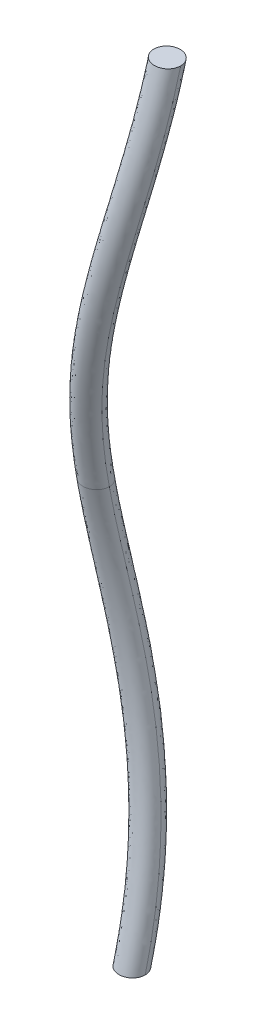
ISO-10303-21;
HEADER;
FILE_DESCRIPTION(('STEP AP214'),'2;1');
FILE_NAME('part.step','',(''),(''),'','','');
FILE_SCHEMA(('AUTOMOTIVE_DESIGN { 1 0 10303 214 1 1 1 1 }'));
ENDSEC;
DATA;
#1=APPLICATION_CONTEXT('core data for automotive mechanical design processes');
#2=APPLICATION_PROTOCOL_DEFINITION('international standard','automotive_design',2000,#1);
#3=PRODUCT_CONTEXT('',#1,'mechanical');
#4=PRODUCT('Part','Part','',(#3));
#5=PRODUCT_RELATED_PRODUCT_CATEGORY('part','',(#4));
#6=PRODUCT_DEFINITION_FORMATION('','',#4);
#7=PRODUCT_DEFINITION_CONTEXT('part definition',#1,'design');
#8=PRODUCT_DEFINITION('design','',#6,#7);
#9=PRODUCT_DEFINITION_SHAPE('','',#8);
#10=(LENGTH_UNIT() NAMED_UNIT(*) SI_UNIT(.MILLI.,.METRE.));
#11=(NAMED_UNIT(*) PLANE_ANGLE_UNIT() SI_UNIT($,.RADIAN.));
#12=(NAMED_UNIT(*) SI_UNIT($,.STERADIAN.) SOLID_ANGLE_UNIT());
#13=UNCERTAINTY_MEASURE_WITH_UNIT(LENGTH_MEASURE(1.E-05),#10,'distance_accuracy_value','');
#14=(GEOMETRIC_REPRESENTATION_CONTEXT(3) GLOBAL_UNCERTAINTY_ASSIGNED_CONTEXT((#13)) GLOBAL_UNIT_ASSIGNED_CONTEXT((#10,
#11,#12)) REPRESENTATION_CONTEXT('',''));
#15=CARTESIAN_POINT('',(0.,0.,0.));
#16=DIRECTION('',(0.,0.,1.));
#17=DIRECTION('',(1.,0.,0.));
#18=AXIS2_PLACEMENT_3D('',#15,#16,#17);
#19=CARTESIAN_POINT('',(-49.666083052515,6.47438122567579,-35.56104775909));
#20=DIRECTION('',(-0.0440198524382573,-0.999030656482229,0.));
#21=DIRECTION('',(0.999030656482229,-0.0440198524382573,0.));
#22=AXIS2_PLACEMENT_3D('',#19,#20,#21);
#23=PLANE('',#22);
#24=CARTESIAN_POINT('',(-48.6377300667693,6.42906935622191,-35.5610477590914));
#25=CARTESIAN_POINT('',(-48.6377539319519,6.42907040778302,-35.5329193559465));
#26=CARTESIAN_POINT('',(-48.6353601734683,6.42896493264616,-35.5047980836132));
#27=CARTESIAN_POINT('',(-48.6259132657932,6.42854867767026,-35.4493710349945));
#28=CARTESIAN_POINT('',(-48.6188635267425,6.42823804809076,-35.4220646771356));
#29=CARTESIAN_POINT('',(-48.6002757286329,6.42741902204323,-35.3690129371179));
#30=CARTESIAN_POINT('',(-48.5887355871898,6.42691053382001,-35.3432682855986));
#31=CARTESIAN_POINT('',(-48.5615049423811,6.42571068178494,-35.2940883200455));
#32=CARTESIAN_POINT('',(-48.5458152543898,6.42501935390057,-35.2706525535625));
#33=CARTESIAN_POINT('',(-48.5107384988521,6.42347378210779,-35.2267634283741));
#34=CARTESIAN_POINT('',(-48.4913536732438,6.42261963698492,-35.2063082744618));
#35=CARTESIAN_POINT('',(-48.4494007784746,6.42077108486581,-35.1689167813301));
#36=CARTESIAN_POINT('',(-48.4268282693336,6.41977648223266,-35.1519854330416));
#37=CARTESIAN_POINT('',(-48.3791991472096,6.41767782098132,-35.1221823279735));
#38=CARTESIAN_POINT('',(-48.354146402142,6.41657393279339,-35.1093043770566));
#39=CARTESIAN_POINT('',(-48.3021942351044,6.41428478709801,-35.0879196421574));
#40=CARTESIAN_POINT('',(-48.2752918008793,6.41309939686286,-35.0794201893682));
#41=CARTESIAN_POINT('',(-48.2204426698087,6.41068260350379,-35.0670668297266));
#42=CARTESIAN_POINT('',(-48.192495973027,6.40945120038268,-35.0632129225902));
#43=CARTESIAN_POINT('',(-48.1363999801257,6.40697946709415,-35.0602625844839));
#44=CARTESIAN_POINT('',(-48.1082510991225,6.40573915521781,-35.0611582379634));
#45=CARTESIAN_POINT('',(-48.052460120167,6.40328086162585,-35.0676682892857));
#46=CARTESIAN_POINT('',(-48.0248188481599,6.40206291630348,-35.0732897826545));
#47=CARTESIAN_POINT('',(-47.9709089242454,6.39968750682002,-35.0890903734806));
#48=CARTESIAN_POINT('',(-47.944638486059,6.39852996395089,-35.099263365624));
#49=CARTESIAN_POINT('',(-47.8941574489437,6.39630564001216,-35.1238855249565));
#50=CARTESIAN_POINT('',(-47.8699482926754,6.39523892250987,-35.138337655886));
#51=CARTESIAN_POINT('',(-47.8242988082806,6.39322748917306,-35.1711044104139));
#52=CARTESIAN_POINT('',(-47.8028583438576,6.39228276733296,-35.1894188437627));
#53=CARTESIAN_POINT('',(-47.7633523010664,6.39054202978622,-35.2293916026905));
#54=CARTESIAN_POINT('',(-47.7452868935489,6.38974602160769,-35.2510500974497));
#55=CARTESIAN_POINT('',(-47.7130463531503,6.38832542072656,-35.2970949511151));
#56=CARTESIAN_POINT('',(-47.6988710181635,6.38770081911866,-35.3214811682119));
#57=CARTESIAN_POINT('',(-47.6748009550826,6.38664023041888,-35.3723076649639));
#58=CARTESIAN_POINT('',(-47.664909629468,6.38620439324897,-35.3987495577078));
#59=CARTESIAN_POINT('',(-47.6497214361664,6.38553516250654,-35.4528874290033));
#60=CARTESIAN_POINT('',(-47.6444175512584,6.38530145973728,-35.4805814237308));
#61=CARTESIAN_POINT('',(-47.6396191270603,6.385090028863,-35.5259642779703));
#62=CARTESIAN_POINT('',(-47.6386919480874,6.38504917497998,-35.5435106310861));
#63=CARTESIAN_POINT('',(-47.6386994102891,6.38504950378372,-35.56104775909));
#64=B_SPLINE_CURVE_WITH_KNOTS('',3,(#24,#25,#26,#27,#28,#29,#30,#31,#32,#33,#34,#35,#36,#37,#38,
#39,#40,#41,#42,#43,#44,#45,#46,#47,#48,#49,#50,#51,#52,#53,#54,#55,#56,#57,#58,#59,#60,#61,#62,
#63),.UNSPECIFIED.,.F.,.F.,(4,2,2,2,2,2,2,2,2,2,2,2,2,2,2,2,2,2,2,4),(0.,0.0842731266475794,
0.168484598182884,0.252735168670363,0.336969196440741,0.421152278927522,0.505453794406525,
0.589625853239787,0.673938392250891,0.758250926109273,0.842422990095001,0.926721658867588,
1.01090758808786,1.0951519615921,1.17939218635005,1.26363667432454,1.34787678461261,
1.43218367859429,1.5163613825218,1.56897272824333),.UNSPECIFIED.);
#65=CARTESIAN_POINT('',(-48.6377300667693,6.42906935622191,-35.5610477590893));
#66=VERTEX_POINT('',#65);
#67=CARTESIAN_POINT('',(-47.6386994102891,6.38504950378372,-35.56104775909));
#68=VERTEX_POINT('',#67);
#69=EDGE_CURVE('E56',#66,#68,#64,.T.);
#70=ORIENTED_EDGE('',*,*,#69,.T.);
#71=CARTESIAN_POINT('',(-47.6386994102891,6.38504950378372,-35.56104775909));
#72=CARTESIAN_POINT('',(-47.6386755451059,6.38504845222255,-35.5891761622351));
#73=CARTESIAN_POINT('',(-47.6410693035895,6.38515392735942,-35.6172974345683));
#74=CARTESIAN_POINT('',(-47.6505162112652,6.38557018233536,-35.6727244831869));
#75=CARTESIAN_POINT('',(-47.6575659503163,6.38588081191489,-35.7000308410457));
#76=CARTESIAN_POINT('',(-47.676153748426,6.38669983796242,-35.7530825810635));
#77=CARTESIAN_POINT('',(-47.6876938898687,6.3872083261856,-35.778827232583));
#78=CARTESIAN_POINT('',(-47.7149245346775,6.38840817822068,-35.828007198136));
#79=CARTESIAN_POINT('',(-47.7306142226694,6.38909950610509,-35.8514429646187));
#80=CARTESIAN_POINT('',(-47.7656909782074,6.39064507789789,-35.895332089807));
#81=CARTESIAN_POINT('',(-47.7850758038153,6.39149922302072,-35.9157872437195));
#82=CARTESIAN_POINT('',(-47.8270286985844,6.39334777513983,-35.953178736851));
#83=CARTESIAN_POINT('',(-47.8496012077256,6.39434237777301,-35.9701100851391));
#84=CARTESIAN_POINT('',(-47.8972303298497,6.39644103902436,-35.9999131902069));
#85=CARTESIAN_POINT('',(-47.9222830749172,6.39754492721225,-36.012791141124));
#86=CARTESIAN_POINT('',(-47.9742352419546,6.39983407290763,-36.0341758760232));
#87=CARTESIAN_POINT('',(-48.0011376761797,6.4010194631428,-36.0426753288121));
#88=CARTESIAN_POINT('',(-48.0559868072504,6.40343625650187,-36.0550286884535));
#89=CARTESIAN_POINT('',(-48.0839335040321,6.40466765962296,-36.0588825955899));
#90=CARTESIAN_POINT('',(-48.1400294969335,6.4071393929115,-36.0618329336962));
#91=CARTESIAN_POINT('',(-48.1681783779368,6.40837970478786,-36.0609372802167));
#92=CARTESIAN_POINT('',(-48.2239693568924,6.41083799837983,-36.054427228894));
#93=CARTESIAN_POINT('',(-48.2516106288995,6.41205594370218,-36.0488057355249));
#94=CARTESIAN_POINT('',(-48.3055205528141,6.41443135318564,-36.0330051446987));
#95=CARTESIAN_POINT('',(-48.3317909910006,6.41558889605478,-36.0228321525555));
#96=CARTESIAN_POINT('',(-48.3822720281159,6.41781321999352,-35.9982099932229));
#97=CARTESIAN_POINT('',(-48.406481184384,6.41887993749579,-35.9837578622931));
#98=CARTESIAN_POINT('',(-48.4521306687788,6.4208913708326,-35.9509911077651));
#99=CARTESIAN_POINT('',(-48.473571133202,6.42183609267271,-35.9326766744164));
#100=CARTESIAN_POINT('',(-48.5130771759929,6.42357683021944,-35.8927039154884));
#101=CARTESIAN_POINT('',(-48.5311425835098,6.42437283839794,-35.8710454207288));
#102=CARTESIAN_POINT('',(-48.5633831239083,6.42579343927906,-35.8250005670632));
#103=CARTESIAN_POINT('',(-48.5775584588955,6.42641804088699,-35.8006143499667));
#104=CARTESIAN_POINT('',(-48.6016285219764,6.42747862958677,-35.7497878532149));
#105=CARTESIAN_POINT('',(-48.6115198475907,6.42791446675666,-35.723345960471));
#106=CARTESIAN_POINT('',(-48.6267080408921,6.42858369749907,-35.6692080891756));
#107=CARTESIAN_POINT('',(-48.6320119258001,6.42881740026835,-35.6415140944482));
#108=CARTESIAN_POINT('',(-48.6368103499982,6.42902883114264,-35.5961312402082));
#109=CARTESIAN_POINT('',(-48.6377375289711,6.42906968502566,-35.5785848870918));
#110=CARTESIAN_POINT('',(-48.6377300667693,6.42906935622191,-35.5610477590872));
#111=B_SPLINE_CURVE_WITH_KNOTS('',3,(#71,#72,#73,#74,#75,#76,#77,#78,#79,#80,#81,#82,#83,#84,
#85,#86,#87,#88,#89,#90,#91,#92,#93,#94,#95,#96,#97,#98,#99,#100,#101,#102,#103,#104,#105,#106,
#107,#108,#109,#110),.UNSPECIFIED.,.F.,.F.,(4,2,2,2,2,2,2,2,2,2,2,2,2,2,2,2,2,2,2,4),(0.,
0.0842731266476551,0.16848459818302,0.252735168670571,0.336969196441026,0.421152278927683,
0.505453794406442,0.589625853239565,0.67393839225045,0.75825092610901,0.842422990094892,
0.92672165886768,1.01090758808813,1.09515196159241,1.17939218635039,1.26363667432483,
1.34787678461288,1.43218367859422,1.51636138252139,1.56897272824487),.UNSPECIFIED.);
#112=EDGE_CURVE('E21',#68,#66,#111,.T.);
#113=ORIENTED_EDGE('',*,*,#112,.T.);
#114=EDGE_LOOP('',(#70,#113));
#115=FACE_BOUND('',#114,.T.);
#116=ADVANCED_FACE('F17',(#115),#23,.F.);
#117=CARTESIAN_POINT('',(-48.6377300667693,6.4290693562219,-35.5610477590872));
#118=CARTESIAN_POINT('',(-48.6377300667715,6.42906935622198,-35.9610477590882));
#119=CARTESIAN_POINT('',(-48.3047198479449,6.41439607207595,-36.2277144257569));
#120=CARTESIAN_POINT('',(-47.8884570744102,6.39605446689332,-36.1860477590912));
#121=CARTESIAN_POINT('',(-47.6386994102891,6.38504950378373,-35.8943810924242));
#122=CARTESIAN_POINT('',(-47.6386994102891,6.38504950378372,-35.56104775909));
#123=CARTESIAN_POINT('',(-48.7088522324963,4.8149516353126,-35.2230947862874));
#124=CARTESIAN_POINT('',(-48.7088522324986,4.81495163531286,-35.6230947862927));
#125=CARTESIAN_POINT('',(-48.3768805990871,4.77670765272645,-35.8897614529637));
#126=CARTESIAN_POINT('',(-47.9619160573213,4.7289026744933,-35.8480947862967));
#127=CARTESIAN_POINT('',(-47.7129373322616,4.70021968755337,-35.5564281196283));
#128=CARTESIAN_POINT('',(-47.7129373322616,4.70021968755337,-35.223094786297));
#129=CARTESIAN_POINT('',(-48.9227849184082,3.20712651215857,-34.885141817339));
#130=CARTESIAN_POINT('',(-48.9227849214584,3.20712651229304,-35.2851418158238));
#131=CARTESIAN_POINT('',(-48.5939373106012,3.14540372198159,-35.551808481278));
#132=CARTESIAN_POINT('',(-48.1828777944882,3.06825023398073,-35.5101418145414));
#133=CARTESIAN_POINT('',(-47.9362420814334,3.0219581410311,-35.2184751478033));
#134=CARTESIAN_POINT('',(-47.9362420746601,3.02195814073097,-34.885141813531));
#135=CARTESIAN_POINT('',(-49.2801625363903,1.6074115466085,-34.6264811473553));
#136=CARTESIAN_POINT('',(-49.2801625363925,1.60741154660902,-35.0264811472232));
#137=CARTESIAN_POINT('',(-48.9561828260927,1.52905163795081,-35.2931478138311));
#138=CARTESIAN_POINT('',(-48.5512081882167,1.43110175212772,-35.2514811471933));
#139=CARTESIAN_POINT('',(-48.3082234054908,1.37233182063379,-34.9598144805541));
#140=CARTESIAN_POINT('',(-48.3082234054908,1.3723318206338,-34.626481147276));
#141=CARTESIAN_POINT('',(-50.072771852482,-1.37195798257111,-34.4399559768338));
#142=CARTESIAN_POINT('',(-50.0727718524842,-1.3719579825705,-34.8399559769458));
#143=CARTESIAN_POINT('',(-49.7518119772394,-1.46245750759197,-35.1066226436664));
#144=CARTESIAN_POINT('',(-49.3506121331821,-1.57558191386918,-35.0649559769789));
#145=CARTESIAN_POINT('',(-49.1098922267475,-1.64345655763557,-34.7732893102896));
#146=CARTESIAN_POINT('',(-49.1098922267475,-1.64345655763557,-34.43995597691));
#147=CARTESIAN_POINT('',(-50.7998831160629,-4.35136219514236,-34.7460520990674));
#148=CARTESIAN_POINT('',(-50.7998831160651,-4.3513621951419,-35.1460520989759));
#149=CARTESIAN_POINT('',(-50.4739240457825,-4.42197262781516,-35.4127187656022));
#150=CARTESIAN_POINT('',(-50.066475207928,-4.51023566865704,-35.371052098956));
#151=CARTESIAN_POINT('',(-49.822005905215,-4.56319349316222,-35.0793854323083));
#152=CARTESIAN_POINT('',(-49.822005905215,-4.56319349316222,-34.746052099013));
#153=CARTESIAN_POINT('',(-51.069392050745,-5.7094066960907,-34.9809390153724));
#154=CARTESIAN_POINT('',(-51.0693920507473,-5.70940669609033,-35.3809390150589));
#155=CARTESIAN_POINT('',(-50.7397007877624,-5.76447225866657,-35.6476056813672));
#156=CARTESIAN_POINT('',(-50.32758670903,-5.8333042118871,-35.6059390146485));
#157=CARTESIAN_POINT('',(-50.0803182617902,-5.87460338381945,-35.3142723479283));
#158=CARTESIAN_POINT('',(-50.0803182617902,-5.87460338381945,-34.980939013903));
#159=CARTESIAN_POINT('',(-51.2352042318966,-7.08656705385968,-35.2709933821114));
#160=CARTESIAN_POINT('',(-51.2352042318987,-7.08656705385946,-35.6709933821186));
#161=CARTESIAN_POINT('',(-50.9030853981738,-7.12147032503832,-35.937660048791));
#162=CARTESIAN_POINT('',(-50.4879368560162,-7.16509941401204,-35.8959933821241));
#163=CARTESIAN_POINT('',(-50.2388477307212,-7.19127686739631,-35.6043267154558));
#164=CARTESIAN_POINT('',(-50.2388477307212,-7.19127686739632,-35.270993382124));
#165=CARTESIAN_POINT('',(-51.2960891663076,-8.46835078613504,-35.5610477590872));
#166=CARTESIAN_POINT('',(-51.2960891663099,-8.46835078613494,-35.9610477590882));
#167=CARTESIAN_POINT('',(-50.9630789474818,-8.48302407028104,-36.2277144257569));
#168=CARTESIAN_POINT('',(-50.5468161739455,-8.50136567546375,-36.1860477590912));
#169=CARTESIAN_POINT('',(-50.2970585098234,-8.51237063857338,-35.8943810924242));
#170=CARTESIAN_POINT('',(-50.2970585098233,-8.51237063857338,-35.56104775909));
#171=(BOUNDED_SURFACE() B_SPLINE_SURFACE(5,5,((#117,#118,#119,#120,#121,#122),(#123,#124,#125,
#126,#127,#128),(#129,#130,#131,#132,#133,#134),(#135,#136,#137,#138,#139,#140),(#141,#142,#143,
#144,#145,#146),(#147,#148,#149,#150,#151,#152),(#153,#154,#155,#156,#157,#158),(#159,#160,#161,
#162,#163,#164),(#165,#166,#167,#168,#169,#170)),.UNSPECIFIED.,.F.,.F.,
.F.) B_SPLINE_SURFACE_WITH_KNOTS((6,3,6),(6,6),(0.,8.37540446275,15.3482800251),
(1.5707963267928,3.14159265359),
.UNSPECIFIED.) GEOMETRIC_REPRESENTATION_ITEM() RATIONAL_B_SPLINE_SURFACE(((0.25,
0.24999999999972,0.29999999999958,0.39999999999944,0.59999999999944,1.),(0.25,0.24999999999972,
0.29999999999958,0.39999999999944,0.59999999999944,1.),(0.25,0.24999999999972,0.29999999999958,
0.39999999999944,0.59999999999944,1.),(0.25,0.24999999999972,0.29999999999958,0.39999999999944,
0.59999999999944,1.),(0.25,0.24999999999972,0.29999999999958,0.39999999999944,0.59999999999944,
1.),(0.25,0.24999999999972,0.29999999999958,0.39999999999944,0.59999999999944,1.),(0.25,
0.24999999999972,0.29999999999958,0.39999999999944,0.59999999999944,1.),(0.25,0.24999999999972,
0.29999999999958,0.39999999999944,0.59999999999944,1.),(0.25,0.24999999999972,0.29999999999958,
0.39999999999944,0.59999999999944,1.))) REPRESENTATION_ITEM('') SURFACE());
#172=CARTESIAN_POINT('',(-47.6386994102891,6.38504950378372,-35.56104775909));
#173=CARTESIAN_POINT('',(-47.7129373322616,4.70021968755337,-35.223094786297));
#174=CARTESIAN_POINT('',(-47.9362420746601,3.02195814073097,-34.885141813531));
#175=CARTESIAN_POINT('',(-48.3082234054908,1.3723318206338,-34.626481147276));
#176=CARTESIAN_POINT('',(-49.1098922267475,-1.64345655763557,-34.43995597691));
#177=CARTESIAN_POINT('',(-49.822005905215,-4.56319349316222,-34.746052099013));
#178=CARTESIAN_POINT('',(-50.0803182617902,-5.87460338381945,-34.980939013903));
#179=CARTESIAN_POINT('',(-50.2388477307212,-7.19127686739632,-35.270993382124));
#180=CARTESIAN_POINT('',(-50.2970585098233,-8.51237063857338,-35.56104775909));
#181=B_SPLINE_CURVE_WITH_KNOTS('',5,(#172,#173,#174,#175,#176,#177,#178,#179,#180),
.UNSPECIFIED.,.F.,.F.,(6,3,6),(0.,8.37540446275,15.3482800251),.UNSPECIFIED.);
#182=CARTESIAN_POINT('',(-50.2970585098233,-8.51237063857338,-35.56104775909));
#183=VERTEX_POINT('',#182);
#184=EDGE_CURVE('E62',#68,#183,#181,.T.);
#185=CARTESIAN_POINT('',(-50.7965738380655,-8.49036071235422,-35.5610477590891));
#186=DIRECTION('',(-0.0440198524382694,-0.999030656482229,0.));
#187=DIRECTION('',(-0.999030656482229,0.0440198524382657,3.76088049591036E-12));
#188=AXIS2_PLACEMENT_3D('',#185,#186,#187);
#189=CIRCLE('',#188,0.500000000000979);
#190=CARTESIAN_POINT('',(-51.2960891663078,-8.46835078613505,-35.5610477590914));
#191=VERTEX_POINT('',#190);
#192=EDGE_CURVE('E40',#191,#183,#189,.T.);
#193=CARTESIAN_POINT('',(-48.6377300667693,6.4290693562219,-35.5610477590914));
#194=CARTESIAN_POINT('',(-48.7088522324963,4.8149516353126,-35.2230947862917));
#195=CARTESIAN_POINT('',(-48.9227849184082,3.20712651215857,-34.8851418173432));
#196=CARTESIAN_POINT('',(-49.2801625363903,1.6074115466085,-34.6264811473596));
#197=CARTESIAN_POINT('',(-50.072771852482,-1.37195798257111,-34.439955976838));
#198=CARTESIAN_POINT('',(-50.7998831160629,-4.35136219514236,-34.7460520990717));
#199=CARTESIAN_POINT('',(-51.069392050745,-5.7094066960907,-34.9809390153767));
#200=CARTESIAN_POINT('',(-51.2352042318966,-7.08656705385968,-35.2709933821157));
#201=CARTESIAN_POINT('',(-51.2960891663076,-8.46835078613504,-35.5610477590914));
#202=B_SPLINE_CURVE_WITH_KNOTS('',5,(#193,#194,#195,#196,#197,#198,#199,#200,#201),
.UNSPECIFIED.,.F.,.F.,(6,3,6),(0.,8.37540446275,15.3482800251),.UNSPECIFIED.);
#203=EDGE_CURVE('E57',#191,#66,#202,.F.);
#204=ORIENTED_EDGE('',*,*,#112,.F.);
#205=ORIENTED_EDGE('',*,*,#184,.T.);
#206=ORIENTED_EDGE('',*,*,#192,.F.);
#207=ORIENTED_EDGE('',*,*,#203,.T.);
#208=EDGE_LOOP('',(#204,#205,#206,#207));
#209=FACE_BOUND('',#208,.T.);
#210=ADVANCED_FACE('F63',(#209),#171,.F.);
#211=CARTESIAN_POINT('',(-47.6386994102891,6.38504950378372,-35.56104775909));
#212=CARTESIAN_POINT('',(-47.6386994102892,6.38504950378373,-35.2277144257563));
#213=CARTESIAN_POINT('',(-47.8884570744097,6.39605446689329,-34.9360477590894));
#214=CARTESIAN_POINT('',(-48.3047198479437,6.41439607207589,-34.8943810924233));
#215=CARTESIAN_POINT('',(-48.6377300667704,6.42906935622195,-35.1610477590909));
#216=CARTESIAN_POINT('',(-48.6377300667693,6.4290693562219,-35.5610477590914));
#217=CARTESIAN_POINT('',(-47.7129373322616,4.70021968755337,-35.223094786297));
#218=CARTESIAN_POINT('',(-47.7129373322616,4.70021968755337,-34.8897614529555));
#219=CARTESIAN_POINT('',(-47.9619160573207,4.72890267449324,-34.5980947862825));
#220=CARTESIAN_POINT('',(-48.3768805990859,4.77670765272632,-34.556428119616));
#221=CARTESIAN_POINT('',(-48.7088522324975,4.81495163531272,-34.823094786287));
#222=CARTESIAN_POINT('',(-48.7088522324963,4.8149516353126,-35.2230947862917));
#223=CARTESIAN_POINT('',(-47.9362420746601,3.02195814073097,-34.885141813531));
#224=CARTESIAN_POINT('',(-47.93624207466,3.02195814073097,-34.5518084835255));
#225=CARTESIAN_POINT('',(-48.1828777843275,3.06825023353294,-34.2601418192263));
#226=CARTESIAN_POINT('',(-48.5939373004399,3.14540372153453,-34.2184751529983));
#227=CARTESIAN_POINT('',(-48.9227849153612,3.20712651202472,-34.4851418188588));
#228=CARTESIAN_POINT('',(-48.9227849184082,3.20712651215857,-34.8851418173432));
#229=CARTESIAN_POINT('',(-48.3082234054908,1.3723318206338,-34.626481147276));
#230=CARTESIAN_POINT('',(-48.3082234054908,1.3723318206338,-34.2931478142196));
#231=CARTESIAN_POINT('',(-48.5512081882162,1.43110175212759,-34.0014811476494));
#232=CARTESIAN_POINT('',(-48.9561828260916,1.52905163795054,-33.9598144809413));
#233=CARTESIAN_POINT('',(-49.2801625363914,1.60741154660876,-34.2264811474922));
#234=CARTESIAN_POINT('',(-49.2801625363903,1.6074115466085,-34.6264811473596));
#235=CARTESIAN_POINT('',(-49.1098922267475,-1.64345655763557,-34.43995597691));
#236=CARTESIAN_POINT('',(-49.1098922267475,-1.64345655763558,-34.1066226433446));
#237=CARTESIAN_POINT('',(-49.3506121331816,-1.57558191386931,-33.8149559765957));
#238=CARTESIAN_POINT('',(-49.7518119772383,-1.46245750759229,-33.7732893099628));
#239=CARTESIAN_POINT('',(-50.0727718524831,-1.37195798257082,-34.0399559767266));
#240=CARTESIAN_POINT('',(-50.072771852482,-1.37195798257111,-34.439955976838));
#241=CARTESIAN_POINT('',(-49.822005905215,-4.56319349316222,-34.746052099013));
#242=CARTESIAN_POINT('',(-49.822005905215,-4.56319349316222,-34.4127187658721));
#243=CARTESIAN_POINT('',(-50.0664752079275,-4.51023566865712,-34.1210520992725));
#244=CARTESIAN_POINT('',(-50.4739240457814,-4.42197262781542,-34.0793854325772));
#245=CARTESIAN_POINT('',(-50.799883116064,-4.35136219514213,-34.3460520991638));
#246=CARTESIAN_POINT('',(-50.7998831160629,-4.35136219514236,-34.7460520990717));
#247=CARTESIAN_POINT('',(-50.0803182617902,-5.87460338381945,-34.980939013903));
#248=CARTESIAN_POINT('',(-50.0803182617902,-5.87460338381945,-34.6476056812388));
#249=CARTESIAN_POINT('',(-50.3275867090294,-5.83330421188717,-34.355939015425));
#250=CARTESIAN_POINT('',(-50.7397007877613,-5.76447225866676,-34.3142723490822));
#251=CARTESIAN_POINT('',(-51.0693920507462,-5.70940669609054,-34.5809390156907));
#252=CARTESIAN_POINT('',(-51.069392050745,-5.7094066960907,-34.9809390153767));
#253=CARTESIAN_POINT('',(-50.2388477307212,-7.19127686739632,-35.270993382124));
#254=CARTESIAN_POINT('',(-50.2388477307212,-7.19127686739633,-34.9376600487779));
#255=CARTESIAN_POINT('',(-50.4879368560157,-7.16509941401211,-34.6459933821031));
#256=CARTESIAN_POINT('',(-50.9030853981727,-7.12147032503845,-34.6043267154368));
#257=CARTESIAN_POINT('',(-51.2352042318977,-7.08656705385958,-34.870993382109));
#258=CARTESIAN_POINT('',(-51.2352042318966,-7.08656705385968,-35.2709933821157));
#259=CARTESIAN_POINT('',(-50.2970585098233,-8.51237063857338,-35.56104775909));
#260=CARTESIAN_POINT('',(-50.2970585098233,-8.51237063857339,-35.2277144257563));
#261=CARTESIAN_POINT('',(-50.5468161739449,-8.50136567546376,-34.9360477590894));
#262=CARTESIAN_POINT('',(-50.9630789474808,-8.48302407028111,-34.8943810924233));
#263=CARTESIAN_POINT('',(-51.2960891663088,-8.46835078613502,-35.1610477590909));
#264=CARTESIAN_POINT('',(-51.2960891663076,-8.46835078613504,-35.5610477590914));
#265=(BOUNDED_SURFACE() B_SPLINE_SURFACE(5,5,((#211,#212,#213,#214,#215,#216),(#217,#218,#219,
#220,#221,#222),(#223,#224,#225,#226,#227,#228),(#229,#230,#231,#232,#233,#234),(#235,#236,#237,
#238,#239,#240),(#241,#242,#243,#244,#245,#246),(#247,#248,#249,#250,#251,#252),(#253,#254,#255,
#256,#257,#258),(#259,#260,#261,#262,#263,#264)),.UNSPECIFIED.,.F.,.F.,
.F.) B_SPLINE_SURFACE_WITH_KNOTS((6,3,6),(6,6),(0.,8.37540446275,15.3482800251),(0.,
1.5707963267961),.UNSPECIFIED.) GEOMETRIC_REPRESENTATION_ITEM() RATIONAL_B_SPLINE_SURFACE(((1.,
0.599999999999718,0.399999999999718,0.299999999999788,0.249999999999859,0.25),(1.,
0.599999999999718,0.399999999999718,0.299999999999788,0.249999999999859,0.25),(1.,
0.599999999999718,0.399999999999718,0.299999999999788,0.249999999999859,0.25),(1.,
0.599999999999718,0.399999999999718,0.299999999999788,0.249999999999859,0.25),(1.,
0.599999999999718,0.399999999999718,0.299999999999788,0.249999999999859,0.25),(1.,
0.599999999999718,0.399999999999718,0.299999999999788,0.249999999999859,0.25),(1.,
0.599999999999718,0.399999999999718,0.299999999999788,0.249999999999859,0.25),(1.,
0.599999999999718,0.399999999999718,0.299999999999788,0.249999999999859,0.25),(1.,
0.599999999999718,0.399999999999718,0.299999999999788,0.249999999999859,0.25))) REPRESENTATION_ITEM('') SURFACE());
#266=CARTESIAN_POINT('',(-50.7965738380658,-8.49036071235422,-35.5610477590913));
#267=DIRECTION('',(0.0440198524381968,0.999030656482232,0.));
#268=DIRECTION('',(0.999030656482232,-0.0440198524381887,2.66453525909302E-12));
#269=AXIS2_PLACEMENT_3D('',#266,#267,#268);
#270=CIRCLE('',#269,0.50000000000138);
#271=EDGE_CURVE('E90',#191,#183,#270,.T.);
#272=ORIENTED_EDGE('',*,*,#69,.F.);
#273=ORIENTED_EDGE('',*,*,#203,.F.);
#274=ORIENTED_EDGE('',*,*,#271,.T.);
#275=ORIENTED_EDGE('',*,*,#184,.F.);
#276=EDGE_LOOP('',(#272,#273,#274,#275));
#277=FACE_BOUND('',#276,.T.);
#278=ADVANCED_FACE('F59',(#277),#265,.F.);
#279=CARTESIAN_POINT('',(-50.9866786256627,-23.4965384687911,-35.56104775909));
#280=DIRECTION('',(-0.0440198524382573,-0.999030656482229,0.));
#281=DIRECTION('',(0.999030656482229,-0.0440198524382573,0.));
#282=AXIS2_PLACEMENT_3D('',#279,#280,#281);
#283=PLANE('',#282);
#284=CARTESIAN_POINT('',(-48.9592949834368,-23.5858701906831,-35.56104775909));
#285=CARTESIAN_POINT('',(-48.9592711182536,-23.5858712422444,-35.5329193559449));
#286=CARTESIAN_POINT('',(-48.9616648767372,-23.5857657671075,-35.5047980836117));
#287=CARTESIAN_POINT('',(-48.9711117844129,-23.5853495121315,-35.4493710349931));
#288=CARTESIAN_POINT('',(-48.978161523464,-23.585038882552,-35.4220646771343));
#289=CARTESIAN_POINT('',(-48.9967493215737,-23.5842198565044,-35.3690129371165));
#290=CARTESIAN_POINT('',(-49.0082894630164,-23.5837113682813,-35.343268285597));
#291=CARTESIAN_POINT('',(-49.0355201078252,-23.5825115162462,-35.294088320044));
#292=CARTESIAN_POINT('',(-49.0512097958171,-23.5818201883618,-35.2706525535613));
#293=CARTESIAN_POINT('',(-49.0862865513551,-23.580274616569,-35.226763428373));
#294=CARTESIAN_POINT('',(-49.1056713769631,-23.5794204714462,-35.2063082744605));
#295=CARTESIAN_POINT('',(-49.1476242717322,-23.5775719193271,-35.168916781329));
#296=CARTESIAN_POINT('',(-49.1701967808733,-23.5765773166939,-35.1519854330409));
#297=CARTESIAN_POINT('',(-49.2178259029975,-23.5744786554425,-35.1221823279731));
#298=CARTESIAN_POINT('',(-49.242878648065,-23.5733747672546,-35.109304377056));
#299=CARTESIAN_POINT('',(-49.2948308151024,-23.5710856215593,-35.0879196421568));
#300=CARTESIAN_POINT('',(-49.3217332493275,-23.5699002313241,-35.0794201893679));
#301=CARTESIAN_POINT('',(-49.3765823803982,-23.567483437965,-35.0670668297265));
#302=CARTESIAN_POINT('',(-49.4045290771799,-23.5662520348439,-35.0632129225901));
#303=CARTESIAN_POINT('',(-49.4606250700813,-23.5637803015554,-35.0602625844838));
#304=CARTESIAN_POINT('',(-49.4887739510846,-23.562539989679,-35.0611582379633));
#305=CARTESIAN_POINT('',(-49.5445649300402,-23.5600816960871,-35.067668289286));
#306=CARTESIAN_POINT('',(-49.5722062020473,-23.5588637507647,-35.0732897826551));
#307=CARTESIAN_POINT('',(-49.6261161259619,-23.5564883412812,-35.0890903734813));
#308=CARTESIAN_POINT('',(-49.6523865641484,-23.5553307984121,-35.0992633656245));
#309=CARTESIAN_POINT('',(-49.7028676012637,-23.5531064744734,-35.1238855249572));
#310=CARTESIAN_POINT('',(-49.7270767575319,-23.5520397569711,-35.1383376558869));
#311=CARTESIAN_POINT('',(-49.7727262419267,-23.5500283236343,-35.1711044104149));
#312=CARTESIAN_POINT('',(-49.7941667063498,-23.5490836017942,-35.1894188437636));
#313=CARTESIAN_POINT('',(-49.8336727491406,-23.5473428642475,-35.2293916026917));
#314=CARTESIAN_POINT('',(-49.8517381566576,-23.546546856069,-35.2510500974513));
#315=CARTESIAN_POINT('',(-49.8839786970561,-23.5451262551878,-35.2970949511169));
#316=CARTESIAN_POINT('',(-49.8981540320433,-23.5445016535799,-35.3214811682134));
#317=CARTESIAN_POINT('',(-49.9222240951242,-23.5434410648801,-35.3723076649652));
#318=CARTESIAN_POINT('',(-49.9321154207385,-23.5430052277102,-35.398749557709));
#319=CARTESIAN_POINT('',(-49.9473036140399,-23.5423359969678,-35.4528874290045));
#320=CARTESIAN_POINT('',(-49.9526074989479,-23.5421022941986,-35.4805814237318));
#321=CARTESIAN_POINT('',(-49.9574059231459,-23.5418908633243,-35.5259642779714));
#322=CARTESIAN_POINT('',(-49.9583331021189,-23.5418500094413,-35.5435106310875));
#323=CARTESIAN_POINT('',(-49.958325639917,-23.541850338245,-35.5610477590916));
#324=B_SPLINE_CURVE_WITH_KNOTS('',3,(#284,#285,#286,#287,#288,#289,#290,#291,#292,#293,#294,
#295,#296,#297,#298,#299,#300,#301,#302,#303,#304,#305,#306,#307,#308,#309,#310,#311,#312,#313,
#314,#315,#316,#317,#318,#319,#320,#321,#322,#323),.UNSPECIFIED.,.F.,.F.,(4,2,2,2,2,2,2,2,2,2,2,
2,2,2,2,2,2,2,2,4),(0.,0.0842731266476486,0.168484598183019,0.252735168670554,0.336969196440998,
0.42115227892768,0.505453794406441,0.5896258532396,0.673938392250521,0.7582509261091,
0.84242299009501,0.926721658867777,1.01090758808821,1.09515196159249,1.17939218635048,
1.26363667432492,1.34787678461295,1.43218367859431,1.51636138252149,1.56897272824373),.UNSPECIFIED.);
#325=CARTESIAN_POINT('',(-48.9592949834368,-23.5858701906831,-35.56104775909));
#326=VERTEX_POINT('',#325);
#327=CARTESIAN_POINT('',(-49.958325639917,-23.541850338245,-35.5610477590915));
#328=VERTEX_POINT('',#327);
#329=EDGE_CURVE('E79',#326,#328,#324,.T.);
#330=ORIENTED_EDGE('',*,*,#329,.T.);
#331=CARTESIAN_POINT('',(-49.958325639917,-23.541850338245,-35.5610477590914));
#332=CARTESIAN_POINT('',(-49.9583495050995,-23.5418492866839,-35.5891761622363));
#333=CARTESIAN_POINT('',(-49.9559557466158,-23.5419547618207,-35.6172974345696));
#334=CARTESIAN_POINT('',(-49.9465088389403,-23.5423710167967,-35.6727244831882));
#335=CARTESIAN_POINT('',(-49.9394590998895,-23.5426816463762,-35.7000308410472));
#336=CARTESIAN_POINT('',(-49.9208713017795,-23.5435006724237,-35.7530825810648));
#337=CARTESIAN_POINT('',(-49.9093311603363,-23.5440091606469,-35.778827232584));
#338=CARTESIAN_POINT('',(-49.8821005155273,-23.545209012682,-35.828007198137));
#339=CARTESIAN_POINT('',(-49.8664108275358,-23.5459003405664,-35.8514429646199));
#340=CARTESIAN_POINT('',(-49.8313340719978,-23.5474459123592,-35.8953320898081));
#341=CARTESIAN_POINT('',(-49.8119492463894,-23.5483000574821,-35.9157872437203));
#342=CARTESIAN_POINT('',(-49.76999635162,-23.5501486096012,-35.9531787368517));
#343=CARTESIAN_POINT('',(-49.7474238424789,-23.5511432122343,-35.9701100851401));
#344=CARTESIAN_POINT('',(-49.6997947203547,-23.5532418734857,-35.9999131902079));
#345=CARTESIAN_POINT('',(-49.674741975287,-23.5543457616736,-36.0127911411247));
#346=CARTESIAN_POINT('',(-49.6227898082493,-23.556634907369,-36.0341758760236));
#347=CARTESIAN_POINT('',(-49.5958873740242,-23.5578202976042,-36.0426753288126));
#348=CARTESIAN_POINT('',(-49.5410382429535,-23.5602370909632,-36.0550286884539));
#349=CARTESIAN_POINT('',(-49.5130915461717,-23.5614684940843,-36.0588825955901));
#350=CARTESIAN_POINT('',(-49.4569955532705,-23.5639402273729,-36.0618329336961));
#351=CARTESIAN_POINT('',(-49.4288466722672,-23.5651805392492,-36.0609372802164));
#352=CARTESIAN_POINT('',(-49.3730556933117,-23.5676388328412,-36.0544272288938));
#353=CARTESIAN_POINT('',(-49.3454144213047,-23.5688567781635,-36.0488057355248));
#354=CARTESIAN_POINT('',(-49.2915044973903,-23.571232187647,-36.0330051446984));
#355=CARTESIAN_POINT('',(-49.265234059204,-23.5723897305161,-36.0228321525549));
#356=CARTESIAN_POINT('',(-49.2147530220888,-23.5746140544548,-35.998209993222));
#357=CARTESIAN_POINT('',(-49.1905438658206,-23.5756807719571,-35.9837578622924));
#358=CARTESIAN_POINT('',(-49.144894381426,-23.5776922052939,-35.9509911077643));
#359=CARTESIAN_POINT('',(-49.1234539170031,-23.578636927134,-35.9326766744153));
#360=CARTESIAN_POINT('',(-49.0839478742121,-23.5803776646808,-35.8927039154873));
#361=CARTESIAN_POINT('',(-49.0658824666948,-23.5811736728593,-35.871045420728));
#362=CARTESIAN_POINT('',(-49.0336419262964,-23.5825942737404,-35.8250005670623));
#363=CARTESIAN_POINT('',(-49.0194665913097,-23.5832188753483,-35.8006143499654));
#364=CARTESIAN_POINT('',(-48.9953965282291,-23.5842794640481,-35.7497878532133));
#365=CARTESIAN_POINT('',(-48.9855052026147,-23.584715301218,-35.7233459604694));
#366=CARTESIAN_POINT('',(-48.9703170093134,-23.5853845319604,-35.6692080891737));
#367=CARTESIAN_POINT('',(-48.9650131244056,-23.5856182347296,-35.6415140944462));
#368=CARTESIAN_POINT('',(-48.9602147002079,-23.5858296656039,-35.5961312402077));
#369=CARTESIAN_POINT('',(-48.9592875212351,-23.5858705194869,-35.5785848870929));
#370=CARTESIAN_POINT('',(-48.9592949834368,-23.5858701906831,-35.56104775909));
#371=B_SPLINE_CURVE_WITH_KNOTS('',3,(#331,#332,#333,#334,#335,#336,#337,#338,#339,#340,#341,
#342,#343,#344,#345,#346,#347,#348,#349,#350,#351,#352,#353,#354,#355,#356,#357,#358,#359,#360,
#361,#362,#363,#364,#365,#366,#367,#368,#369,#370),.UNSPECIFIED.,.F.,.F.,(4,2,2,2,2,2,2,2,2,2,2,
2,2,2,2,2,2,2,2,4),(0.,0.0842731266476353,0.168484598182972,0.252735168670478,0.336969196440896,
0.421152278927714,0.505453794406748,0.589625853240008,0.673938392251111,0.758250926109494,
0.842422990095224,0.926721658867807,1.01090758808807,1.09515196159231,1.17939218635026,
1.26363667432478,1.3478767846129,1.43218367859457,1.51636138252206,1.5689727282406),.UNSPECIFIED.);
#372=EDGE_CURVE('E92',#328,#326,#371,.T.);
#373=ORIENTED_EDGE('',*,*,#372,.T.);
#374=EDGE_LOOP('',(#330,#373));
#375=FACE_BOUND('',#374,.T.);
#376=ADVANCED_FACE('F112',(#375),#283,.T.);
#377=CARTESIAN_POINT('',(-50.2970585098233,-8.51237063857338,-35.56104775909));
#378=CARTESIAN_POINT('',(-50.2970585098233,-8.51237063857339,-35.2277144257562));
#379=CARTESIAN_POINT('',(-50.546816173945,-8.50136567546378,-34.9360477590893));
#380=CARTESIAN_POINT('',(-50.963078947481,-8.48302407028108,-34.8943810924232));
#381=CARTESIAN_POINT('',(-51.296089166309,-8.46835078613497,-35.1610477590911));
#382=CARTESIAN_POINT('',(-51.2960891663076,-8.46835078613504,-35.5610477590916));
#383=CARTESIAN_POINT('',(-50.3660172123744,-10.0773885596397,-35.904657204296));
#384=CARTESIAN_POINT('',(-50.3660172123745,-10.0773885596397,-35.5713238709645));
#385=CARTESIAN_POINT('',(-50.6165668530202,-10.084357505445,-35.2796572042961));
#386=CARTESIAN_POINT('',(-51.0341495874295,-10.0959724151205,-35.2379905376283));
#387=CARTESIAN_POINT('',(-51.3682157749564,-10.1052643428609,-35.5046572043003));
#388=CARTESIAN_POINT('',(-51.368215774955,-10.1052643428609,-35.9046572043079));
#389=CARTESIAN_POINT('',(-50.2941919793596,-11.6486094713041,-36.248266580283));
#390=CARTESIAN_POINT('',(-50.2941919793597,-11.6486094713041,-35.9149332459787));
#391=CARTESIAN_POINT('',(-50.5439167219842,-11.6736235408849,-35.6232665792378));
#392=CARTESIAN_POINT('',(-50.9601246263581,-11.7153136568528,-35.5815999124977));
#393=CARTESIAN_POINT('',(-51.2930909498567,-11.7486657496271,-35.8482665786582));
#394=CARTESIAN_POINT('',(-51.2930909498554,-11.7486657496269,-36.2482665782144));
#395=CARTESIAN_POINT('',(-50.0819870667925,-13.225347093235,-36.499146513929));
#396=CARTESIAN_POINT('',(-50.0819870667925,-13.225347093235,-36.1658131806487));
#397=CARTESIAN_POINT('',(-50.329171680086,-13.2626932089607,-35.8741465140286));
#398=CARTESIAN_POINT('',(-50.7411460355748,-13.32493673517,-35.8324798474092));
#399=CARTESIAN_POINT('',(-51.0707255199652,-13.3747315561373,-36.0991465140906));
#400=CARTESIAN_POINT('',(-51.0707255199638,-13.3747315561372,-36.4991465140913));
#401=CARTESIAN_POINT('',(-49.5629593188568,-16.2140326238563,-36.68030879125));
#402=CARTESIAN_POINT('',(-49.5629593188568,-16.2140326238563,-36.3469754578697));
#403=CARTESIAN_POINT('',(-49.8087308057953,-16.2603810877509,-36.0553087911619));
#404=CARTESIAN_POINT('',(-50.2183499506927,-16.3376285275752,-36.0136421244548));
#405=CARTESIAN_POINT('',(-50.5460452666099,-16.3994264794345,-36.2803087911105));
#406=CARTESIAN_POINT('',(-50.5460452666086,-16.3994264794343,-36.6803087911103));
#407=CARTESIAN_POINT('',(-49.0924130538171,-19.2998778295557,-36.372305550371));
#408=CARTESIAN_POINT('',(-49.0924130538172,-19.2998778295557,-36.038972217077));
#409=CARTESIAN_POINT('',(-49.3406223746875,-19.3309427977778,-35.7473055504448));
#410=CARTESIAN_POINT('',(-49.7543045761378,-19.3827177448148,-35.7056388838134));
#411=CARTESIAN_POINT('',(-50.0852503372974,-19.4241377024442,-35.972305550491));
#412=CARTESIAN_POINT('',(-50.0852503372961,-19.424137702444,-36.3723055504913));
#413=CARTESIAN_POINT('',(-48.9404746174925,-20.727159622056,-36.133519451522));
#414=CARTESIAN_POINT('',(-48.9404746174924,-20.7271596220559,-35.8001861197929));
#415=CARTESIAN_POINT('',(-49.1904297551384,-20.7461495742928,-35.5085194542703));
#416=CARTESIAN_POINT('',(-49.6070216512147,-20.7777994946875,-35.4668527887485));
#417=CARTESIAN_POINT('',(-49.9402951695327,-20.8031194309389,-35.733519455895));
#418=CARTESIAN_POINT('',(-49.9402951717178,-20.8031194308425,-36.1335194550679));
#419=CARTESIAN_POINT('',(-48.8964177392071,-22.1588709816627,-35.847283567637));
#420=CARTESIAN_POINT('',(-48.8964177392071,-22.1588709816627,-35.5139502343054));
#421=CARTESIAN_POINT('',(-49.1468351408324,-22.1628387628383,-35.2222835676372));
#422=CARTESIAN_POINT('',(-49.564197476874,-22.1694517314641,-35.1806169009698));
#423=CARTESIAN_POINT('',(-49.8980873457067,-22.1747421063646,-35.4472835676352));
#424=CARTESIAN_POINT('',(-49.8980873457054,-22.1747421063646,-35.8472835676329));
#425=CARTESIAN_POINT('',(-48.9592949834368,-23.5858701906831,-35.56104775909));
#426=CARTESIAN_POINT('',(-48.9592949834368,-23.5858701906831,-35.2277144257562));
#427=CARTESIAN_POINT('',(-49.2090526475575,-23.5748652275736,-34.9360477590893));
#428=CARTESIAN_POINT('',(-49.6253154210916,-23.556523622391,-34.8943810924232));
#429=CARTESIAN_POINT('',(-49.9583256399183,-23.5418503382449,-35.1610477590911));
#430=CARTESIAN_POINT('',(-49.958325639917,-23.541850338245,-35.5610477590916));
#431=(BOUNDED_SURFACE() B_SPLINE_SURFACE(5,5,((#377,#378,#379,#380,#381,#382),(#383,#384,#385,
#386,#387,#388),(#389,#390,#391,#392,#393,#394),(#395,#396,#397,#398,#399,#400),(#401,#402,#403,
#404,#405,#406),(#407,#408,#409,#410,#411,#412),(#413,#414,#415,#416,#417,#418),(#419,#420,#421,
#422,#423,#424),(#425,#426,#427,#428,#429,#430)),.UNSPECIFIED.,.F.,.F.,
.F.) B_SPLINE_SURFACE_WITH_KNOTS((6,3,6),(6,6),(0.,8.26033356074,15.3540444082),(0.,
1.57079632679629),.UNSPECIFIED.) GEOMETRIC_REPRESENTATION_ITEM() RATIONAL_B_SPLINE_SURFACE(((1.,
0.599999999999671,0.399999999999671,0.299999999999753,0.249999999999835,0.25),(1.,
0.599999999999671,0.399999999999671,0.299999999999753,0.249999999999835,0.25),(1.,
0.599999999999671,0.399999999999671,0.299999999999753,0.249999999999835,0.25),(1.,
0.599999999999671,0.399999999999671,0.299999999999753,0.249999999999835,0.25),(1.,
0.599999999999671,0.399999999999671,0.299999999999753,0.249999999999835,0.25),(1.,
0.599999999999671,0.399999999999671,0.299999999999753,0.249999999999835,0.25),(1.,
0.599999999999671,0.399999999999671,0.299999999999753,0.249999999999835,0.25),(1.,
0.599999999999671,0.399999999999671,0.299999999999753,0.249999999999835,0.25),(1.,
0.599999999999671,0.399999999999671,0.299999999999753,0.249999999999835,0.25))) REPRESENTATION_ITEM('') SURFACE());
#432=CARTESIAN_POINT('',(-51.2960891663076,-8.46835078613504,-35.5610477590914));
#433=CARTESIAN_POINT('',(-51.368215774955,-10.1052643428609,-35.9046572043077));
#434=CARTESIAN_POINT('',(-51.2930909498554,-11.7486657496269,-36.2482665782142));
#435=CARTESIAN_POINT('',(-51.0707255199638,-13.3747315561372,-36.4991465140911));
#436=CARTESIAN_POINT('',(-50.5460452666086,-16.3994264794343,-36.6803087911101));
#437=CARTESIAN_POINT('',(-50.0852503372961,-19.424137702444,-36.372305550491));
#438=CARTESIAN_POINT('',(-49.9402951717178,-20.8031194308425,-36.1335194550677));
#439=CARTESIAN_POINT('',(-49.8980873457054,-22.1747421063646,-35.8472835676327));
#440=CARTESIAN_POINT('',(-49.958325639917,-23.541850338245,-35.5610477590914));
#441=B_SPLINE_CURVE_WITH_KNOTS('',5,(#432,#433,#434,#435,#436,#437,#438,#439,#440),
.UNSPECIFIED.,.F.,.F.,(6,3,6),(0.,8.26033356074,15.3540444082),.UNSPECIFIED.);
#442=EDGE_CURVE('E11',#191,#328,#441,.T.);
#443=CARTESIAN_POINT('',(-50.2970585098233,-8.51237063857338,-35.56104775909));
#444=CARTESIAN_POINT('',(-50.3660172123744,-10.0773885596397,-35.904657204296));
#445=CARTESIAN_POINT('',(-50.2941919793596,-11.6486094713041,-36.248266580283));
#446=CARTESIAN_POINT('',(-50.0819870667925,-13.225347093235,-36.49914651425));
#447=CARTESIAN_POINT('',(-49.5629593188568,-16.2140326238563,-36.68030879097));
#448=CARTESIAN_POINT('',(-49.0924130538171,-19.2998778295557,-36.372305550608));
#449=CARTESIAN_POINT('',(-48.9404746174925,-20.727159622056,-36.133519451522));
#450=CARTESIAN_POINT('',(-48.8964177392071,-22.1588709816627,-35.847283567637));
#451=CARTESIAN_POINT('',(-48.9592949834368,-23.5858701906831,-35.56104775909));
#452=B_SPLINE_CURVE_WITH_KNOTS('',5,(#443,#444,#445,#446,#447,#448,#449,#450,#451),
.UNSPECIFIED.,.F.,.F.,(6,3,6),(0.,8.26033356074,15.3540444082),.UNSPECIFIED.);
#453=EDGE_CURVE('E31',#326,#183,#452,.F.);
#454=ORIENTED_EDGE('',*,*,#271,.F.);
#455=ORIENTED_EDGE('',*,*,#442,.T.);
#456=ORIENTED_EDGE('',*,*,#329,.F.);
#457=ORIENTED_EDGE('',*,*,#453,.T.);
#458=EDGE_LOOP('',(#454,#455,#456,#457));
#459=FACE_BOUND('',#458,.T.);
#460=ADVANCED_FACE('F116',(#459),#431,.F.);
#461=CARTESIAN_POINT('',(-51.2960891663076,-8.46835078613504,-35.5610477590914));
#462=CARTESIAN_POINT('',(-51.2960891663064,-8.46835078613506,-35.9610477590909));
#463=CARTESIAN_POINT('',(-50.9630789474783,-8.48302407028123,-36.2277144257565));
#464=CARTESIAN_POINT('',(-50.5468161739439,-8.50136567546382,-36.1860477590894));
#465=CARTESIAN_POINT('',(-50.2970585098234,-8.5123706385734,-35.8943810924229));
#466=CARTESIAN_POINT('',(-50.2970585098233,-8.51237063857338,-35.56104775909));
#467=CARTESIAN_POINT('',(-51.368215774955,-10.1052643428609,-35.9046572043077));
#468=CARTESIAN_POINT('',(-51.3682157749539,-10.1052643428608,-36.3046572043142));
#469=CARTESIAN_POINT('',(-51.0341495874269,-10.0959724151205,-36.5713238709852));
#470=CARTESIAN_POINT('',(-50.616566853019,-10.084357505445,-36.5296572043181));
#471=CARTESIAN_POINT('',(-50.3660172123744,-10.0773885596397,-36.237990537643));
#472=CARTESIAN_POINT('',(-50.3660172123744,-10.0773885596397,-35.904657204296));
#473=CARTESIAN_POINT('',(-51.2930909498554,-11.7486657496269,-36.2482665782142));
#474=CARTESIAN_POINT('',(-51.2930909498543,-11.7486657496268,-36.6482665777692));
#475=CARTESIAN_POINT('',(-50.9601246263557,-11.7153136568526,-36.9149332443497));
#476=CARTESIAN_POINT('',(-50.5439167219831,-11.6736235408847,-36.8732665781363));
#477=CARTESIAN_POINT('',(-50.2941919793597,-11.6486094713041,-36.5815999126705));
#478=CARTESIAN_POINT('',(-50.2941919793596,-11.6486094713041,-36.248266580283));
#479=CARTESIAN_POINT('',(-51.0707255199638,-13.3747315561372,-36.4991465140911));
#480=CARTESIAN_POINT('',(-51.0707255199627,-13.374731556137,-36.8991465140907));
#481=CARTESIAN_POINT('',(-50.7411460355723,-13.3249367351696,-37.1658131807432));
#482=CARTESIAN_POINT('',(-50.3291716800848,-13.2626932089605,-37.1241465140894));
#483=CARTESIAN_POINT('',(-50.0819870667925,-13.225347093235,-36.8324798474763));
#484=CARTESIAN_POINT('',(-50.0819870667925,-13.225347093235,-36.49914651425));
#485=CARTESIAN_POINT('',(-50.5460452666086,-16.3994264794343,-36.6803087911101));
#486=CARTESIAN_POINT('',(-50.5460452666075,-16.399426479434,-37.0803087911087));
#487=CARTESIAN_POINT('',(-50.2183499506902,-16.3376285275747,-37.3469754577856));
#488=CARTESIAN_POINT('',(-49.8087308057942,-16.2603810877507,-37.3053087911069));
#489=CARTESIAN_POINT('',(-49.5629593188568,-16.2140326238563,-37.0136421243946));
#490=CARTESIAN_POINT('',(-49.5629593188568,-16.2140326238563,-36.68030879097));
#491=CARTESIAN_POINT('',(-50.0852503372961,-19.424137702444,-36.372305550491));
#492=CARTESIAN_POINT('',(-50.0852503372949,-19.4241377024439,-36.7723055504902));
#493=CARTESIAN_POINT('',(-49.7543045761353,-19.3827177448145,-37.0389722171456));
#494=CARTESIAN_POINT('',(-49.3406223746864,-19.3309427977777,-36.9973055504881));
#495=CARTESIAN_POINT('',(-49.0924130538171,-19.2998778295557,-36.7056388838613));
#496=CARTESIAN_POINT('',(-49.0924130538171,-19.2998778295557,-36.372305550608));
#497=CARTESIAN_POINT('',(-49.9402951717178,-20.8031194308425,-36.1335194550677));
#498=CARTESIAN_POINT('',(-49.940295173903,-20.803119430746,-36.5335194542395));
#499=CARTESIAN_POINT('',(-49.6070216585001,-20.7777994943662,-36.8001861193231));
#500=CARTESIAN_POINT('',(-49.1904297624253,-20.7461495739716,-36.7585194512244));
#501=CARTESIAN_POINT('',(-48.9404746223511,-20.727159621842,-36.4668527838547));
#502=CARTESIAN_POINT('',(-48.9404746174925,-20.727159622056,-36.133519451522));
#503=CARTESIAN_POINT('',(-49.8980873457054,-22.1747421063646,-35.8472835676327));
#504=CARTESIAN_POINT('',(-49.8980873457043,-22.1747421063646,-36.2472835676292));
#505=CARTESIAN_POINT('',(-49.5641974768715,-22.169451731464,-36.5139502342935));
#506=CARTESIAN_POINT('',(-49.1468351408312,-22.1628387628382,-36.4722835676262));
#507=CARTESIAN_POINT('',(-48.8964177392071,-22.1588709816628,-36.1806169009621));
#508=CARTESIAN_POINT('',(-48.8964177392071,-22.1588709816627,-35.847283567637));
#509=CARTESIAN_POINT('',(-49.958325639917,-23.541850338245,-35.5610477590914));
#510=CARTESIAN_POINT('',(-49.9583256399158,-23.541850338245,-35.9610477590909));
#511=CARTESIAN_POINT('',(-49.6253154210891,-23.5565236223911,-36.2277144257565));
#512=CARTESIAN_POINT('',(-49.2090526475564,-23.5748652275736,-36.1860477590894));
#513=CARTESIAN_POINT('',(-48.9592949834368,-23.5858701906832,-35.8943810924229));
#514=CARTESIAN_POINT('',(-48.9592949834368,-23.5858701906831,-35.56104775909));
#515=(BOUNDED_SURFACE() B_SPLINE_SURFACE(5,5,((#461,#462,#463,#464,#465,#466),(#467,#468,#469,
#470,#471,#472),(#473,#474,#475,#476,#477,#478),(#479,#480,#481,#482,#483,#484),(#485,#486,#487,
#488,#489,#490),(#491,#492,#493,#494,#495,#496),(#497,#498,#499,#500,#501,#502),(#503,#504,#505,
#506,#507,#508),(#509,#510,#511,#512,#513,#514)),.UNSPECIFIED.,.F.,.F.,
.F.) B_SPLINE_SURFACE_WITH_KNOTS((6,3,6),(6,6),(0.,8.26033356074,15.3540444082),
(1.5707963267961,3.14159265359),
.UNSPECIFIED.) GEOMETRIC_REPRESENTATION_ITEM() RATIONAL_B_SPLINE_SURFACE(((0.25,
0.250000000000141,0.300000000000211,0.400000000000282,0.600000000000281,1.),(0.25,
0.250000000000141,0.300000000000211,0.400000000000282,0.600000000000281,1.),(0.25,
0.250000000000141,0.300000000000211,0.400000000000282,0.600000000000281,1.),(0.25,
0.250000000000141,0.300000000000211,0.400000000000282,0.600000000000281,1.),(0.25,
0.250000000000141,0.300000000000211,0.400000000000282,0.600000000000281,1.),(0.25,
0.250000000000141,0.300000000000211,0.400000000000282,0.600000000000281,1.),(0.25,
0.250000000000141,0.300000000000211,0.400000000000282,0.600000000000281,1.),(0.25,
0.250000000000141,0.300000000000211,0.400000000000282,0.600000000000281,1.),(0.25,
0.250000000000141,0.300000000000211,0.400000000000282,0.600000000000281,1.))) REPRESENTATION_ITEM('') SURFACE());
#516=ORIENTED_EDGE('',*,*,#192,.T.);
#517=ORIENTED_EDGE('',*,*,#453,.F.);
#518=ORIENTED_EDGE('',*,*,#372,.F.);
#519=ORIENTED_EDGE('',*,*,#442,.F.);
#520=EDGE_LOOP('',(#516,#517,#518,#519));
#521=FACE_BOUND('',#520,.T.);
#522=ADVANCED_FACE('F108',(#521),#515,.F.);
#523=CLOSED_SHELL('',(#116,#210,#278,#376,#460,#522));
#524=MANIFOLD_SOLID_BREP('B1',#523);
#525=ADVANCED_BREP_SHAPE_REPRESENTATION('',(#18,#524),#14);
#526=SHAPE_DEFINITION_REPRESENTATION(#9,#525);
ENDSEC;
END-ISO-10303-21;
